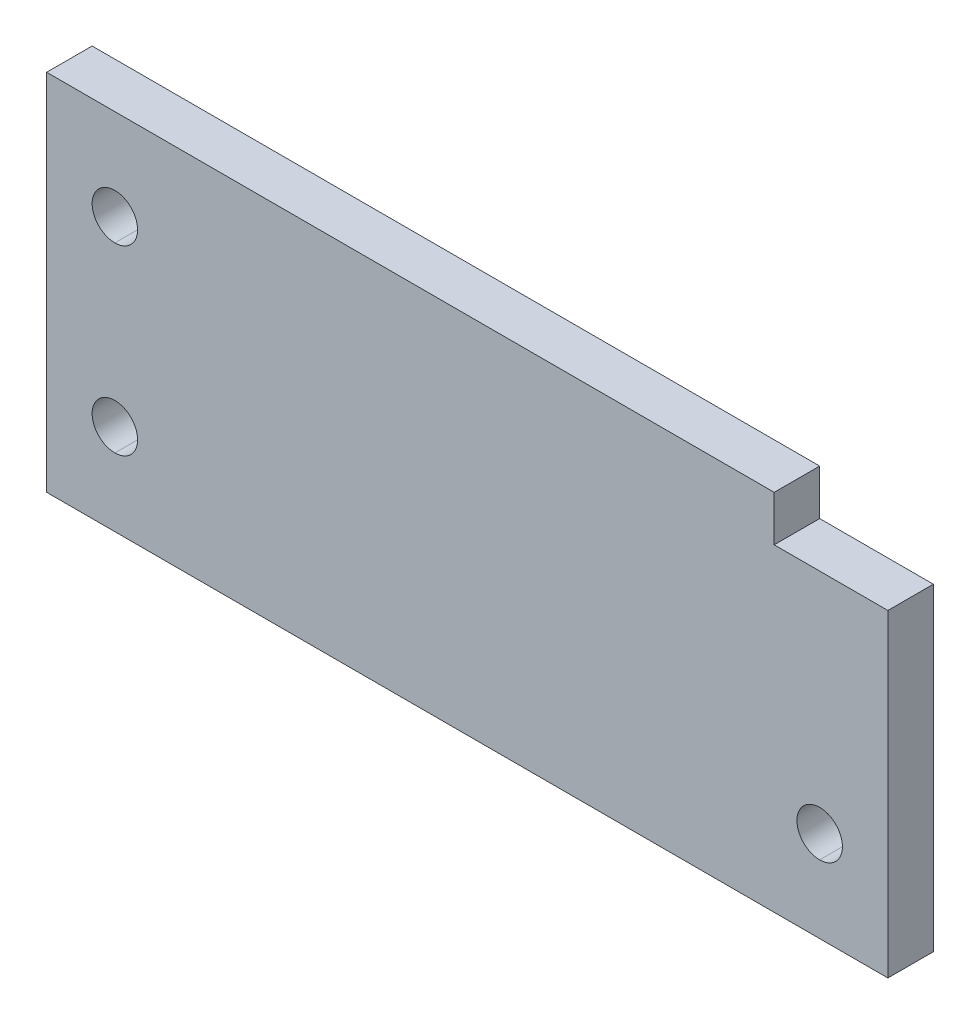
ISO-10303-21;
HEADER;
FILE_DESCRIPTION(('STEP AP214'),'2;1');
FILE_NAME('part.step','',(''),(''),'','','');
FILE_SCHEMA(('AUTOMOTIVE_DESIGN { 1 0 10303 214 1 1 1 1 }'));
ENDSEC;
DATA;
#1=APPLICATION_CONTEXT('core data for automotive mechanical design processes');
#2=APPLICATION_PROTOCOL_DEFINITION('international standard','automotive_design',2000,#1);
#3=PRODUCT_CONTEXT('',#1,'mechanical');
#4=PRODUCT('Part','Part','',(#3));
#5=PRODUCT_RELATED_PRODUCT_CATEGORY('part','',(#4));
#6=PRODUCT_DEFINITION_FORMATION('','',#4);
#7=PRODUCT_DEFINITION_CONTEXT('part definition',#1,'design');
#8=PRODUCT_DEFINITION('design','',#6,#7);
#9=PRODUCT_DEFINITION_SHAPE('','',#8);
#10=(LENGTH_UNIT() NAMED_UNIT(*) SI_UNIT(.MILLI.,.METRE.));
#11=(NAMED_UNIT(*) PLANE_ANGLE_UNIT() SI_UNIT($,.RADIAN.));
#12=(NAMED_UNIT(*) SI_UNIT($,.STERADIAN.) SOLID_ANGLE_UNIT());
#13=UNCERTAINTY_MEASURE_WITH_UNIT(LENGTH_MEASURE(1.E-05),#10,'distance_accuracy_value','');
#14=(GEOMETRIC_REPRESENTATION_CONTEXT(3) GLOBAL_UNCERTAINTY_ASSIGNED_CONTEXT((#13)) GLOBAL_UNIT_ASSIGNED_CONTEXT((#10,
#11,#12)) REPRESENTATION_CONTEXT('',''));
#15=CARTESIAN_POINT('',(0.,0.,0.));
#16=DIRECTION('',(0.,0.,1.));
#17=DIRECTION('',(1.,0.,0.));
#18=AXIS2_PLACEMENT_3D('',#15,#16,#17);
#19=CARTESIAN_POINT('',(85.7250886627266,50.8,6.34999999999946));
#20=DIRECTION('',(0.,0.,-1.));
#21=DIRECTION('',(-1.,0.,0.));
#22=AXIS2_PLACEMENT_3D('',#19,#20,#21);
#23=PLANE('',#22);
#24=DIRECTION('',(1.,0.,0.));
#25=VECTOR('',#24,1.);
#26=CARTESIAN_POINT('',(-117.474911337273,50.8,6.34999999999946));
#27=LINE('',#26,#25);
#28=CARTESIAN_POINT('',(-117.474911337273,50.8,6.34999999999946));
#29=VERTEX_POINT('',#28);
#30=CARTESIAN_POINT('',(85.7250886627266,50.8,6.34999999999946));
#31=VERTEX_POINT('',#30);
#32=EDGE_CURVE('E155',#29,#31,#27,.T.);
#33=ORIENTED_EDGE('',*,*,#32,.F.);
#34=DIRECTION('',(0.,1.,0.));
#35=VECTOR('',#34,1.);
#36=CARTESIAN_POINT('',(-117.474911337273,-50.8,6.34999999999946));
#37=LINE('',#36,#35);
#38=CARTESIAN_POINT('',(-117.474911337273,-50.8,6.34999999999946));
#39=VERTEX_POINT('',#38);
#40=EDGE_CURVE('E181',#39,#29,#37,.T.);
#41=ORIENTED_EDGE('',*,*,#40,.F.);
#42=DIRECTION('',(1.,0.,0.));
#43=VECTOR('',#42,1.);
#44=CARTESIAN_POINT('',(117.474911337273,-50.8,6.34999999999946));
#45=LINE('',#44,#43);
#46=CARTESIAN_POINT('',(117.474911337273,-50.8,6.34999999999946));
#47=VERTEX_POINT('',#46);
#48=EDGE_CURVE('E176',#47,#39,#45,.F.);
#49=ORIENTED_EDGE('',*,*,#48,.F.);
#50=DIRECTION('',(0.,1.,0.));
#51=VECTOR('',#50,1.);
#52=CARTESIAN_POINT('',(117.474911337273,38.1,6.34999999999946));
#53=LINE('',#52,#51);
#54=CARTESIAN_POINT('',(117.474911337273,38.1,6.34999999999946));
#55=VERTEX_POINT('',#54);
#56=EDGE_CURVE('E170',#55,#47,#53,.F.);
#57=ORIENTED_EDGE('',*,*,#56,.F.);
#58=DIRECTION('',(1.,0.,0.));
#59=VECTOR('',#58,1.);
#60=CARTESIAN_POINT('',(85.7250886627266,38.1,6.34999999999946));
#61=LINE('',#60,#59);
#62=CARTESIAN_POINT('',(85.7250886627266,38.1,6.34999999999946));
#63=VERTEX_POINT('',#62);
#64=EDGE_CURVE('E164',#63,#55,#61,.T.);
#65=ORIENTED_EDGE('',*,*,#64,.F.);
#66=DIRECTION('',(0.,1.,0.));
#67=VECTOR('',#66,1.);
#68=CARTESIAN_POINT('',(85.7250886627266,50.8,6.34999999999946));
#69=LINE('',#68,#67);
#70=EDGE_CURVE('E158',#31,#63,#69,.F.);
#71=ORIENTED_EDGE('',*,*,#70,.F.);
#72=EDGE_LOOP('',(#33,#41,#49,#57,#65,#71));
#73=FACE_BOUND('',#72,.T.);
#74=CARTESIAN_POINT('',(-98.4249113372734,25.4,6.34999999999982));
#75=DIRECTION('',(0.,0.,-1.));
#76=DIRECTION('',(-1.,0.,0.));
#77=AXIS2_PLACEMENT_3D('',#74,#75,#76);
#78=CIRCLE('',#77,6.35);
#79=CARTESIAN_POINT('',(-98.4249113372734,19.05,6.35000000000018));
#80=VERTEX_POINT('',#79);
#81=CARTESIAN_POINT('',(-98.4249113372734,31.75,6.35000000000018));
#82=VERTEX_POINT('',#81);
#83=EDGE_CURVE('E130',#80,#82,#78,.T.);
#84=ORIENTED_EDGE('',*,*,#83,.T.);
#85=CARTESIAN_POINT('',(-98.4249113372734,25.4,6.35000000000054));
#86=DIRECTION('',(0.,0.,-1.));
#87=DIRECTION('',(-1.,0.,0.));
#88=AXIS2_PLACEMENT_3D('',#85,#86,#87);
#89=CIRCLE('',#88,6.35);
#90=EDGE_CURVE('E127',#82,#80,#89,.T.);
#91=ORIENTED_EDGE('',*,*,#90,.T.);
#92=EDGE_LOOP('',(#84,#91));
#93=FACE_BOUND('',#92,.T.);
#94=CARTESIAN_POINT('',(-98.4249113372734,-25.4,6.34999999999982));
#95=DIRECTION('',(0.,0.,-1.));
#96=DIRECTION('',(-1.,0.,0.));
#97=AXIS2_PLACEMENT_3D('',#94,#95,#96);
#98=CIRCLE('',#97,6.35);
#99=CARTESIAN_POINT('',(-98.4249113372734,-31.75,6.35000000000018));
#100=VERTEX_POINT('',#99);
#101=CARTESIAN_POINT('',(-98.4249113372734,-19.05,6.35000000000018));
#102=VERTEX_POINT('',#101);
#103=EDGE_CURVE('E124',#100,#102,#98,.T.);
#104=ORIENTED_EDGE('',*,*,#103,.T.);
#105=CARTESIAN_POINT('',(-98.4249113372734,-25.4,6.35000000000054));
#106=DIRECTION('',(0.,0.,-1.));
#107=DIRECTION('',(-1.,0.,0.));
#108=AXIS2_PLACEMENT_3D('',#105,#106,#107);
#109=CIRCLE('',#108,6.35);
#110=EDGE_CURVE('E119',#102,#100,#109,.T.);
#111=ORIENTED_EDGE('',*,*,#110,.T.);
#112=EDGE_LOOP('',(#104,#111));
#113=FACE_BOUND('',#112,.T.);
#114=CARTESIAN_POINT('',(98.4249113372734,-25.4,6.34999999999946));
#115=DIRECTION('',(0.,0.,1.));
#116=DIRECTION('',(1.,0.,0.));
#117=AXIS2_PLACEMENT_3D('',#114,#115,#116);
#118=CIRCLE('',#117,6.35);
#119=CARTESIAN_POINT('',(98.4249113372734,-31.75,6.35));
#120=VERTEX_POINT('',#119);
#121=CARTESIAN_POINT('',(98.4249113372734,-19.05,6.35));
#122=VERTEX_POINT('',#121);
#123=EDGE_CURVE('E103',#120,#122,#118,.F.);
#124=ORIENTED_EDGE('',*,*,#123,.T.);
#125=CARTESIAN_POINT('',(98.4249113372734,-25.4,6.35000000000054));
#126=DIRECTION('',(0.,0.,1.));
#127=DIRECTION('',(1.,0.,0.));
#128=AXIS2_PLACEMENT_3D('',#125,#126,#127);
#129=CIRCLE('',#128,6.35);
#130=EDGE_CURVE('E19',#122,#120,#129,.F.);
#131=ORIENTED_EDGE('',*,*,#130,.T.);
#132=EDGE_LOOP('',(#124,#131));
#133=FACE_BOUND('',#132,.T.);
#134=ADVANCED_FACE('F16',(#73,#93,#113,#133),#23,.F.);
#135=CARTESIAN_POINT('',(98.4249113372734,-25.4,-11.4299999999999));
#136=DIRECTION('',(0.,0.,1.));
#137=DIRECTION('',(1.,0.,0.));
#138=AXIS2_PLACEMENT_3D('',#135,#136,#137);
#139=CYLINDRICAL_SURFACE('',#138,6.35);
#140=CARTESIAN_POINT('',(98.4249113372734,-25.4,-6.35000000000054));
#141=DIRECTION('',(0.,0.,1.));
#142=DIRECTION('',(1.,0.,0.));
#143=AXIS2_PLACEMENT_3D('',#140,#141,#142);
#144=CIRCLE('',#143,6.35);
#145=CARTESIAN_POINT('',(98.4249113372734,-31.75,-6.35000000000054));
#146=VERTEX_POINT('',#145);
#147=CARTESIAN_POINT('',(98.4249113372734,-19.05,-6.35000000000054));
#148=VERTEX_POINT('',#147);
#149=EDGE_CURVE('E112',#146,#148,#144,.T.);
#150=ORIENTED_EDGE('',*,*,#149,.F.);
#151=DIRECTION('',(0.,0.,1.));
#152=VECTOR('',#151,1.);
#153=CARTESIAN_POINT('',(98.4249113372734,-31.75,-11.4299999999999));
#154=LINE('',#153,#152);
#155=EDGE_CURVE('E108',#146,#120,#154,.T.);
#156=ORIENTED_EDGE('',*,*,#155,.T.);
#157=ORIENTED_EDGE('',*,*,#130,.F.);
#158=DIRECTION('',(0.,0.,1.));
#159=VECTOR('',#158,1.);
#160=CARTESIAN_POINT('',(98.4249113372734,-19.05,-11.4299999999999));
#161=LINE('',#160,#159);
#162=EDGE_CURVE('E118',#122,#148,#161,.F.);
#163=ORIENTED_EDGE('',*,*,#162,.T.);
#164=EDGE_LOOP('',(#150,#156,#157,#163));
#165=FACE_BOUND('',#164,.T.);
#166=ADVANCED_FACE('F110',(#165),#139,.F.);
#167=CARTESIAN_POINT('',(98.4249113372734,-25.4,-11.4299999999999));
#168=DIRECTION('',(0.,0.,1.));
#169=DIRECTION('',(1.,0.,0.));
#170=AXIS2_PLACEMENT_3D('',#167,#168,#169);
#171=CYLINDRICAL_SURFACE('',#170,6.35);
#172=ORIENTED_EDGE('',*,*,#123,.F.);
#173=ORIENTED_EDGE('',*,*,#155,.F.);
#174=CARTESIAN_POINT('',(98.4249113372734,-25.4,-6.35000000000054));
#175=DIRECTION('',(0.,0.,1.));
#176=DIRECTION('',(1.,0.,0.));
#177=AXIS2_PLACEMENT_3D('',#174,#175,#176);
#178=CIRCLE('',#177,6.35);
#179=EDGE_CURVE('E134',#148,#146,#178,.T.);
#180=ORIENTED_EDGE('',*,*,#179,.F.);
#181=ORIENTED_EDGE('',*,*,#162,.F.);
#182=EDGE_LOOP('',(#172,#173,#180,#181));
#183=FACE_BOUND('',#182,.T.);
#184=ADVANCED_FACE('F117',(#183),#171,.F.);
#185=CARTESIAN_POINT('',(-98.4249113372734,-25.4,-11.4299999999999));
#186=DIRECTION('',(0.,0.,-1.));
#187=DIRECTION('',(-1.,0.,0.));
#188=AXIS2_PLACEMENT_3D('',#185,#186,#187);
#189=CYLINDRICAL_SURFACE('',#188,6.35);
#190=CARTESIAN_POINT('',(-98.4249113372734,-25.4,-6.35000000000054));
#191=DIRECTION('',(0.,0.,-1.));
#192=DIRECTION('',(-1.,0.,0.));
#193=AXIS2_PLACEMENT_3D('',#190,#191,#192);
#194=CIRCLE('',#193,6.35);
#195=CARTESIAN_POINT('',(-98.4249113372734,-31.75,-6.35000000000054));
#196=VERTEX_POINT('',#195);
#197=CARTESIAN_POINT('',(-98.4249113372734,-19.05,-6.35000000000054));
#198=VERTEX_POINT('',#197);
#199=EDGE_CURVE('E136',#196,#198,#194,.F.);
#200=ORIENTED_EDGE('',*,*,#199,.F.);
#201=DIRECTION('',(0.,0.,-1.));
#202=VECTOR('',#201,1.);
#203=CARTESIAN_POINT('',(-98.4249113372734,-31.75,-11.4299999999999));
#204=LINE('',#203,#202);
#205=EDGE_CURVE('E123',#196,#100,#204,.F.);
#206=ORIENTED_EDGE('',*,*,#205,.T.);
#207=ORIENTED_EDGE('',*,*,#110,.F.);
#208=DIRECTION('',(0.,0.,-1.));
#209=VECTOR('',#208,1.);
#210=CARTESIAN_POINT('',(-98.4249113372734,-19.05,-11.4299999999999));
#211=LINE('',#210,#209);
#212=EDGE_CURVE('E126',#102,#198,#211,.T.);
#213=ORIENTED_EDGE('',*,*,#212,.T.);
#214=EDGE_LOOP('',(#200,#206,#207,#213));
#215=FACE_BOUND('',#214,.T.);
#216=ADVANCED_FACE('F249',(#215),#189,.F.);
#217=CARTESIAN_POINT('',(-98.4249113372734,-25.4,-11.4299999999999));
#218=DIRECTION('',(0.,0.,-1.));
#219=DIRECTION('',(-1.,0.,0.));
#220=AXIS2_PLACEMENT_3D('',#217,#218,#219);
#221=CYLINDRICAL_SURFACE('',#220,6.35);
#222=ORIENTED_EDGE('',*,*,#103,.F.);
#223=ORIENTED_EDGE('',*,*,#205,.F.);
#224=CARTESIAN_POINT('',(-98.4249113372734,-25.4,-6.35000000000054));
#225=DIRECTION('',(0.,0.,-1.));
#226=DIRECTION('',(-1.,0.,0.));
#227=AXIS2_PLACEMENT_3D('',#224,#225,#226);
#228=CIRCLE('',#227,6.35);
#229=EDGE_CURVE('E139',#198,#196,#228,.F.);
#230=ORIENTED_EDGE('',*,*,#229,.F.);
#231=ORIENTED_EDGE('',*,*,#212,.F.);
#232=EDGE_LOOP('',(#222,#223,#230,#231));
#233=FACE_BOUND('',#232,.T.);
#234=ADVANCED_FACE('F245',(#233),#221,.F.);
#235=CARTESIAN_POINT('',(-98.4249113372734,25.4,-11.4299999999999));
#236=DIRECTION('',(0.,0.,-1.));
#237=DIRECTION('',(-1.,0.,0.));
#238=AXIS2_PLACEMENT_3D('',#235,#236,#237);
#239=CYLINDRICAL_SURFACE('',#238,6.35);
#240=CARTESIAN_POINT('',(-98.4249113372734,25.4,-6.35000000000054));
#241=DIRECTION('',(0.,0.,-1.));
#242=DIRECTION('',(-1.,0.,0.));
#243=AXIS2_PLACEMENT_3D('',#240,#241,#242);
#244=CIRCLE('',#243,6.35);
#245=CARTESIAN_POINT('',(-98.4249113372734,19.05,-6.35000000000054));
#246=VERTEX_POINT('',#245);
#247=CARTESIAN_POINT('',(-98.4249113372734,31.75,-6.35000000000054));
#248=VERTEX_POINT('',#247);
#249=EDGE_CURVE('E142',#246,#248,#244,.F.);
#250=ORIENTED_EDGE('',*,*,#249,.F.);
#251=DIRECTION('',(0.,0.,-1.));
#252=VECTOR('',#251,1.);
#253=CARTESIAN_POINT('',(-98.4249113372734,19.05,-11.4299999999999));
#254=LINE('',#253,#252);
#255=EDGE_CURVE('E129',#246,#80,#254,.F.);
#256=ORIENTED_EDGE('',*,*,#255,.T.);
#257=ORIENTED_EDGE('',*,*,#90,.F.);
#258=DIRECTION('',(0.,0.,-1.));
#259=VECTOR('',#258,1.);
#260=CARTESIAN_POINT('',(-98.4249113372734,31.75,-11.4299999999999));
#261=LINE('',#260,#259);
#262=EDGE_CURVE('E132',#82,#248,#261,.T.);
#263=ORIENTED_EDGE('',*,*,#262,.T.);
#264=EDGE_LOOP('',(#250,#256,#257,#263));
#265=FACE_BOUND('',#264,.T.);
#266=ADVANCED_FACE('F241',(#265),#239,.F.);
#267=CARTESIAN_POINT('',(-98.4249113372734,25.4,-11.4299999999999));
#268=DIRECTION('',(0.,0.,-1.));
#269=DIRECTION('',(-1.,0.,0.));
#270=AXIS2_PLACEMENT_3D('',#267,#268,#269);
#271=CYLINDRICAL_SURFACE('',#270,6.35);
#272=ORIENTED_EDGE('',*,*,#83,.F.);
#273=ORIENTED_EDGE('',*,*,#255,.F.);
#274=CARTESIAN_POINT('',(-98.4249113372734,25.4,-6.35000000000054));
#275=DIRECTION('',(0.,0.,-1.));
#276=DIRECTION('',(-1.,0.,0.));
#277=AXIS2_PLACEMENT_3D('',#274,#275,#276);
#278=CIRCLE('',#277,6.35);
#279=EDGE_CURVE('E145',#248,#246,#278,.F.);
#280=ORIENTED_EDGE('',*,*,#279,.F.);
#281=ORIENTED_EDGE('',*,*,#262,.F.);
#282=EDGE_LOOP('',(#272,#273,#280,#281));
#283=FACE_BOUND('',#282,.T.);
#284=ADVANCED_FACE('F238',(#283),#271,.F.);
#285=CARTESIAN_POINT('',(-117.474911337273,50.8,-6.35000000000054));
#286=DIRECTION('',(0.,1.,0.));
#287=DIRECTION('',(0.,0.,1.));
#288=AXIS2_PLACEMENT_3D('',#285,#286,#287);
#289=PLANE('',#288);
#290=DIRECTION('',(-1.,0.,0.));
#291=VECTOR('',#290,1.);
#292=CARTESIAN_POINT('',(28.5750295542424,50.8,-6.35000000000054));
#293=LINE('',#292,#291);
#294=CARTESIAN_POINT('',(-117.474911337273,50.8,-6.35000000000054));
#295=VERTEX_POINT('',#294);
#296=CARTESIAN_POINT('',(85.7250886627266,50.8,-6.35000000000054));
#297=VERTEX_POINT('',#296);
#298=EDGE_CURVE('E147',#295,#297,#293,.F.);
#299=ORIENTED_EDGE('',*,*,#298,.F.);
#300=DIRECTION('',(0.,0.,1.));
#301=VECTOR('',#300,1.);
#302=CARTESIAN_POINT('',(-117.474911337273,50.8,-6.35000000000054));
#303=LINE('',#302,#301);
#304=EDGE_CURVE('E184',#29,#295,#303,.F.);
#305=ORIENTED_EDGE('',*,*,#304,.F.);
#306=ORIENTED_EDGE('',*,*,#32,.T.);
#307=DIRECTION('',(0.,0.,-1.));
#308=VECTOR('',#307,1.);
#309=CARTESIAN_POINT('',(85.7250886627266,50.8,-6.35000000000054));
#310=LINE('',#309,#308);
#311=EDGE_CURVE('E161',#297,#31,#310,.F.);
#312=ORIENTED_EDGE('',*,*,#311,.F.);
#313=EDGE_LOOP('',(#299,#305,#306,#312));
#314=FACE_BOUND('',#313,.T.);
#315=ADVANCED_FACE('F217',(#314),#289,.T.);
#316=CARTESIAN_POINT('',(85.7250886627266,50.8,-6.35000000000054));
#317=DIRECTION('',(1.,0.,0.));
#318=DIRECTION('',(0.,0.,-1.));
#319=AXIS2_PLACEMENT_3D('',#316,#317,#318);
#320=PLANE('',#319);
#321=DIRECTION('',(0.,1.,0.));
#322=VECTOR('',#321,1.);
#323=CARTESIAN_POINT('',(85.7250886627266,12.7,-6.35000000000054));
#324=LINE('',#323,#322);
#325=CARTESIAN_POINT('',(85.7250886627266,38.1,-6.35000000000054));
#326=VERTEX_POINT('',#325);
#327=EDGE_CURVE('E190',#297,#326,#324,.F.);
#328=ORIENTED_EDGE('',*,*,#327,.F.);
#329=ORIENTED_EDGE('',*,*,#311,.T.);
#330=ORIENTED_EDGE('',*,*,#70,.T.);
#331=DIRECTION('',(0.,0.,1.));
#332=VECTOR('',#331,1.);
#333=CARTESIAN_POINT('',(85.7250886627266,38.1,-6.35000000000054));
#334=LINE('',#333,#332);
#335=EDGE_CURVE('E167',#326,#63,#334,.T.);
#336=ORIENTED_EDGE('',*,*,#335,.F.);
#337=EDGE_LOOP('',(#328,#329,#330,#336));
#338=FACE_BOUND('',#337,.T.);
#339=ADVANCED_FACE('F214',(#338),#320,.T.);
#340=CARTESIAN_POINT('',(85.7250886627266,38.1,-6.35000000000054));
#341=DIRECTION('',(0.,1.,0.));
#342=DIRECTION('',(0.,0.,1.));
#343=AXIS2_PLACEMENT_3D('',#340,#341,#342);
#344=PLANE('',#343);
#345=DIRECTION('',(-1.,0.,0.));
#346=VECTOR('',#345,1.);
#347=CARTESIAN_POINT('',(28.5750295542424,38.1,-6.35000000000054));
#348=LINE('',#347,#346);
#349=CARTESIAN_POINT('',(117.474911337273,38.1,-6.35000000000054));
#350=VERTEX_POINT('',#349);
#351=EDGE_CURVE('E193',#326,#350,#348,.F.);
#352=ORIENTED_EDGE('',*,*,#351,.F.);
#353=ORIENTED_EDGE('',*,*,#335,.T.);
#354=ORIENTED_EDGE('',*,*,#64,.T.);
#355=DIRECTION('',(0.,0.,-1.));
#356=VECTOR('',#355,1.);
#357=CARTESIAN_POINT('',(117.474911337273,38.1,-6.35000000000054));
#358=LINE('',#357,#356);
#359=EDGE_CURVE('E173',#350,#55,#358,.F.);
#360=ORIENTED_EDGE('',*,*,#359,.F.);
#361=EDGE_LOOP('',(#352,#353,#354,#360));
#362=FACE_BOUND('',#361,.T.);
#363=ADVANCED_FACE('F211',(#362),#344,.T.);
#364=CARTESIAN_POINT('',(117.474911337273,38.1,-6.35000000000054));
#365=DIRECTION('',(1.,0.,0.));
#366=DIRECTION('',(0.,0.,-1.));
#367=AXIS2_PLACEMENT_3D('',#364,#365,#366);
#368=PLANE('',#367);
#369=DIRECTION('',(0.,1.,0.));
#370=VECTOR('',#369,1.);
#371=CARTESIAN_POINT('',(117.474911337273,12.7,-6.35000000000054));
#372=LINE('',#371,#370);
#373=CARTESIAN_POINT('',(117.474911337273,-50.8,-6.35000000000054));
#374=VERTEX_POINT('',#373);
#375=EDGE_CURVE('E196',#350,#374,#372,.F.);
#376=ORIENTED_EDGE('',*,*,#375,.F.);
#377=ORIENTED_EDGE('',*,*,#359,.T.);
#378=ORIENTED_EDGE('',*,*,#56,.T.);
#379=DIRECTION('',(0.,0.,-1.));
#380=VECTOR('',#379,1.);
#381=CARTESIAN_POINT('',(117.474911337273,-50.8,-6.35000000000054));
#382=LINE('',#381,#380);
#383=EDGE_CURVE('E178',#374,#47,#382,.F.);
#384=ORIENTED_EDGE('',*,*,#383,.F.);
#385=EDGE_LOOP('',(#376,#377,#378,#384));
#386=FACE_BOUND('',#385,.T.);
#387=ADVANCED_FACE('F206',(#386),#368,.T.);
#388=CARTESIAN_POINT('',(117.474911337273,-50.8,-6.35000000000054));
#389=DIRECTION('',(0.,-1.,0.));
#390=DIRECTION('',(0.,0.,-1.));
#391=AXIS2_PLACEMENT_3D('',#388,#389,#390);
#392=PLANE('',#391);
#393=DIRECTION('',(-1.,0.,0.));
#394=VECTOR('',#393,1.);
#395=CARTESIAN_POINT('',(28.5750295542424,-50.8,-6.35000000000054));
#396=LINE('',#395,#394);
#397=CARTESIAN_POINT('',(-117.474911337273,-50.8,-6.35000000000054));
#398=VERTEX_POINT('',#397);
#399=EDGE_CURVE('E25',#374,#398,#396,.T.);
#400=ORIENTED_EDGE('',*,*,#399,.F.);
#401=ORIENTED_EDGE('',*,*,#383,.T.);
#402=ORIENTED_EDGE('',*,*,#48,.T.);
#403=DIRECTION('',(0.,0.,1.));
#404=VECTOR('',#403,1.);
#405=CARTESIAN_POINT('',(-117.474911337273,-50.8,-6.35000000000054));
#406=LINE('',#405,#404);
#407=EDGE_CURVE('E34',#398,#39,#406,.T.);
#408=ORIENTED_EDGE('',*,*,#407,.F.);
#409=EDGE_LOOP('',(#400,#401,#402,#408));
#410=FACE_BOUND('',#409,.T.);
#411=ADVANCED_FACE('F204',(#410),#392,.T.);
#412=CARTESIAN_POINT('',(-117.474911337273,-50.8,-6.35000000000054));
#413=DIRECTION('',(-1.,0.,0.));
#414=DIRECTION('',(0.,0.,1.));
#415=AXIS2_PLACEMENT_3D('',#412,#413,#414);
#416=PLANE('',#415);
#417=DIRECTION('',(0.,1.,0.));
#418=VECTOR('',#417,1.);
#419=CARTESIAN_POINT('',(-117.474911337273,12.7,-6.35000000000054));
#420=LINE('',#419,#418);
#421=EDGE_CURVE('E11',#398,#295,#420,.T.);
#422=ORIENTED_EDGE('',*,*,#421,.F.);
#423=ORIENTED_EDGE('',*,*,#407,.T.);
#424=ORIENTED_EDGE('',*,*,#40,.T.);
#425=ORIENTED_EDGE('',*,*,#304,.T.);
#426=EDGE_LOOP('',(#422,#423,#424,#425));
#427=FACE_BOUND('',#426,.T.);
#428=ADVANCED_FACE('F219',(#427),#416,.T.);
#429=CARTESIAN_POINT('',(28.5750295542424,12.7,-6.35000000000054));
#430=DIRECTION('',(0.,0.,-1.));
#431=DIRECTION('',(-1.,0.,0.));
#432=AXIS2_PLACEMENT_3D('',#429,#430,#431);
#433=PLANE('',#432);
#434=ORIENTED_EDGE('',*,*,#399,.T.);
#435=ORIENTED_EDGE('',*,*,#421,.T.);
#436=ORIENTED_EDGE('',*,*,#298,.T.);
#437=ORIENTED_EDGE('',*,*,#327,.T.);
#438=ORIENTED_EDGE('',*,*,#351,.T.);
#439=ORIENTED_EDGE('',*,*,#375,.T.);
#440=EDGE_LOOP('',(#434,#435,#436,#437,#438,#439));
#441=FACE_BOUND('',#440,.T.);
#442=ORIENTED_EDGE('',*,*,#249,.T.);
#443=ORIENTED_EDGE('',*,*,#279,.T.);
#444=EDGE_LOOP('',(#442,#443));
#445=FACE_BOUND('',#444,.T.);
#446=ORIENTED_EDGE('',*,*,#199,.T.);
#447=ORIENTED_EDGE('',*,*,#229,.T.);
#448=EDGE_LOOP('',(#446,#447));
#449=FACE_BOUND('',#448,.T.);
#450=ORIENTED_EDGE('',*,*,#149,.T.);
#451=ORIENTED_EDGE('',*,*,#179,.T.);
#452=EDGE_LOOP('',(#450,#451));
#453=FACE_BOUND('',#452,.T.);
#454=ADVANCED_FACE('F201',(#441,#445,#449,#453),#433,.T.);
#455=CLOSED_SHELL('',(#134,#166,#184,#216,#234,#266,#284,#315,#339,#363,#387,#411,#428,#454));
#456=MANIFOLD_SOLID_BREP('B1',#455);
#457=ADVANCED_BREP_SHAPE_REPRESENTATION('',(#18,#456),#14);
#458=SHAPE_DEFINITION_REPRESENTATION(#9,#457);
ENDSEC;
END-ISO-10303-21;
